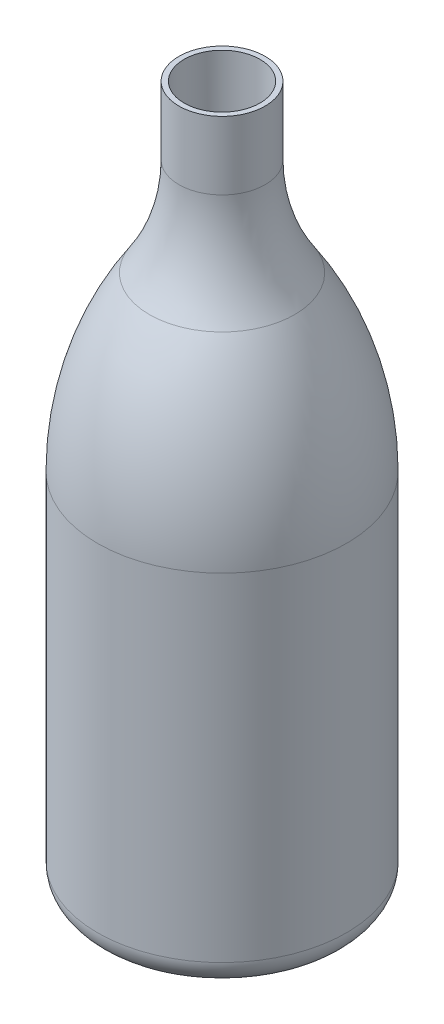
from build123d import *

# Parameters (mm, degrees)
FILLET1_R = 5
SHELL1_T  = -1


with BuildPart() as part:
    # Sketch1 → Revolve1 (revolve)
    with BuildSketch(Plane.XY, mode=Mode.PRIVATE) as revolve1_sk:
        with BuildLine():
            Line((0, 0), (24.089129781, 0))
            Line((24.089129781, 0), (24.089129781, 70.252777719))
            ThreePointArc((24.089129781, 70.252777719), (21.52413, 87.649025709), (14.047438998, 103.564670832))
            ThreePointArc((14.047438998, 103.564670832), (9.798971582, 112.608390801), (8.341466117, 122.493431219))
            Line((8.341466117, 122.493431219), (8.341466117, 135.663330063))
            Line((8.341466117, 135.663330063), (0, 135.663330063))
            Line((0, 135.663330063), (0, 0))
        make_face()
    revolve(revolve1_sk.sketch.rotate(Axis((0, 135.663330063, 0), (0, -1, 0)), 90), axis=Axis((0, 135.663330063, 0), (0, -1, 0)))

    # Fillet1
    fillet1_edges = [part.edges().sort_by_distance(p)[0] for p in [
        (0, 0, -24.089129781),
    ]]
    fillet(fillet1_edges, radius=FILLET1_R)

    # Shell1
    shell1_openings = [part.faces().sort_by_distance(p)[0] for p in [
        (0, 135.663330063, 0),
    ]]
    offset(amount=SHELL1_T, openings=shell1_openings, kind=Kind.INTERSECTION)


solid = part.part
